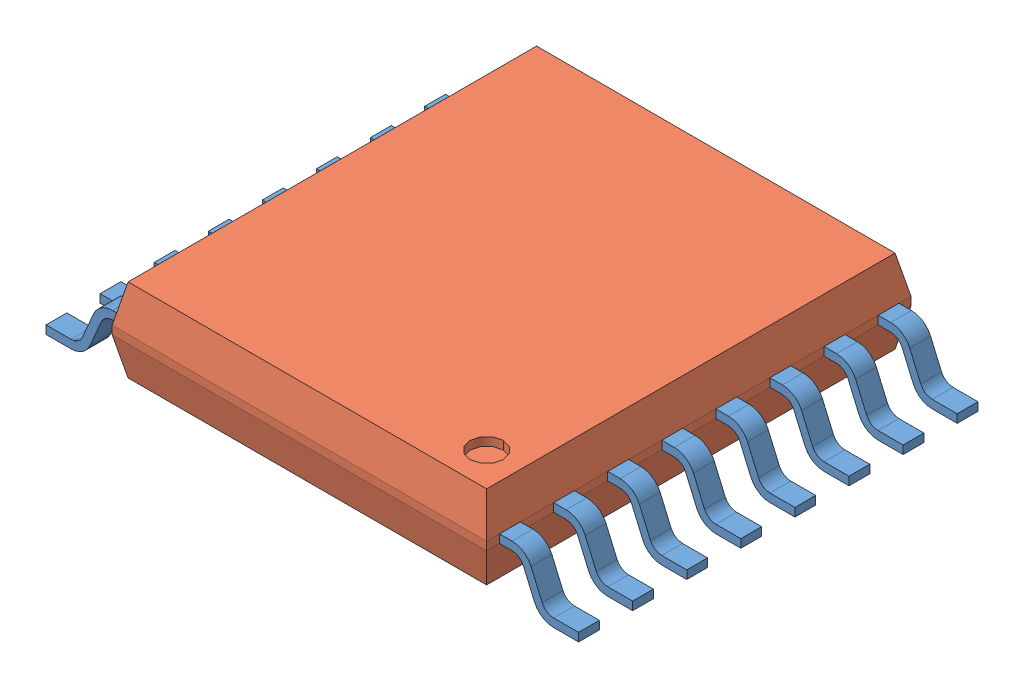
SolidWorks assembly User Library-TSSOP-16 5.1x4.4.sldasm, configuration Default (file format 9000). Lengths in mm.
Overall size (6.4 1.1 5.1).
17 component instances, 2 part files, 0 mates.
Components (placement in the parent):
- User Library-TSSOP-16 5.1x4.4_pin_TSSOP_tssop_1-1: User Library-TSSOP-16 5.1x4.4_pin_TSSOP_tssop_1.sldprt [Default] at (-2.25 0 -0.33) x (0 0 1) z (-1 0 0) size (0.25 0.65 0.95)
- User Library-TSSOP-16 5.1x4.4_pin_TSSOP_tssop_1-2: User Library-TSSOP-16 5.1x4.4_pin_TSSOP_tssop_1.sldprt [Default] at (-2.25 0 2.27) x (0 0 1) z (-1 0 0) size (0.25 0.65 0.95)
- User Library-TSSOP-16 5.1x4.4_pin_TSSOP_tssop_1-3: User Library-TSSOP-16 5.1x4.4_pin_TSSOP_tssop_1.sldprt [Default] at (2.25 0 0.97) x (0 0 -1) z (1 0 0) size (0.25 0.65 0.95)
- User Library-TSSOP-16 5.1x4.4_pin_TSSOP_tssop_1-4: User Library-TSSOP-16 5.1x4.4_pin_TSSOP_tssop_1.sldprt [Default] at (2.25 0 -0.33) x (0 0 -1) z (1 0 0) size (0.25 0.65 0.95)
- User Library-TSSOP-16 5.1x4.4_pin_TSSOP_tssop_1-5: User Library-TSSOP-16 5.1x4.4_pin_TSSOP_tssop_1.sldprt [Default] at (2.25 0 0.32) x (0 0 -1) z (1 0 0) size (0.25 0.65 0.95)
- User Library-TSSOP-16 5.1x4.4_pin_TSSOP_tssop_1-6: User Library-TSSOP-16 5.1x4.4_pin_TSSOP_tssop_1.sldprt [Default] at (-2.25 0 -1.63) x (0 0 1) z (-1 0 0) size (0.25 0.65 0.95)
- User Library-TSSOP-16 5.1x4.4_pin_TSSOP_tssop_1-7: User Library-TSSOP-16 5.1x4.4_pin_TSSOP_tssop_1.sldprt [Default] at (-2.25 0 -0.98) x (0 0 1) z (-1 0 0) size (0.25 0.65 0.95)
- User Library-TSSOP-16 5.1x4.4_pin_TSSOP_tssop_1-8: User Library-TSSOP-16 5.1x4.4_pin_TSSOP_tssop_1.sldprt [Default] at (-2.25 0 1.62) x (0 0 1) z (-1 0 0) size (0.25 0.65 0.95)
- User Library-TSSOP-16 5.1x4.4_body_TSSOP_TSSOP_5.1x4.5_1-1: User Library-TSSOP-16 5.1x4.4_body_TSSOP_TSSOP_5.1x4.5_1.sldprt [Default] at origin size (4.5 1 5.1)
- User Library-TSSOP-16 5.1x4.4_pin_TSSOP_tssop_1-9: User Library-TSSOP-16 5.1x4.4_pin_TSSOP_tssop_1.sldprt [Default] at (2.25 0 -2.28) x (0 0 -1) z (1 0 0) size (0.25 0.65 0.95)
- User Library-TSSOP-16 5.1x4.4_pin_TSSOP_tssop_1-10: User Library-TSSOP-16 5.1x4.4_pin_TSSOP_tssop_1.sldprt [Default] at (2.25 0 2.27) x (0 0 -1) z (1 0 0) size (0.25 0.65 0.95)
- User Library-TSSOP-16 5.1x4.4_pin_TSSOP_tssop_1-11: User Library-TSSOP-16 5.1x4.4_pin_TSSOP_tssop_1.sldprt [Default] at (-2.25 0 -2.28) x (0 0 1) z (-1 0 0) size (0.25 0.65 0.95)
- User Library-TSSOP-16 5.1x4.4_pin_TSSOP_tssop_1-12: User Library-TSSOP-16 5.1x4.4_pin_TSSOP_tssop_1.sldprt [Default] at (2.25 0 -0.98) x (0 0 -1) z (1 0 0) size (0.25 0.65 0.95)
- User Library-TSSOP-16 5.1x4.4_pin_TSSOP_tssop_1-13: User Library-TSSOP-16 5.1x4.4_pin_TSSOP_tssop_1.sldprt [Default] at (2.25 0 -1.63) x (0 0 -1) z (1 0 0) size (0.25 0.65 0.95)
- User Library-TSSOP-16 5.1x4.4_pin_TSSOP_tssop_1-14: User Library-TSSOP-16 5.1x4.4_pin_TSSOP_tssop_1.sldprt [Default] at (-2.25 0 0.32) x (0 0 1) z (-1 0 0) size (0.25 0.65 0.95)
- User Library-TSSOP-16 5.1x4.4_pin_TSSOP_tssop_1-15: User Library-TSSOP-16 5.1x4.4_pin_TSSOP_tssop_1.sldprt [Default] at (2.25 0 1.62) x (0 0 -1) z (1 0 0) size (0.25 0.65 0.95)
- User Library-TSSOP-16 5.1x4.4_pin_TSSOP_tssop_1-16: User Library-TSSOP-16 5.1x4.4_pin_TSSOP_tssop_1.sldprt [Default] at (-2.25 0 0.97) x (0 0 1) z (-1 0 0) size (0.25 0.65 0.95)
